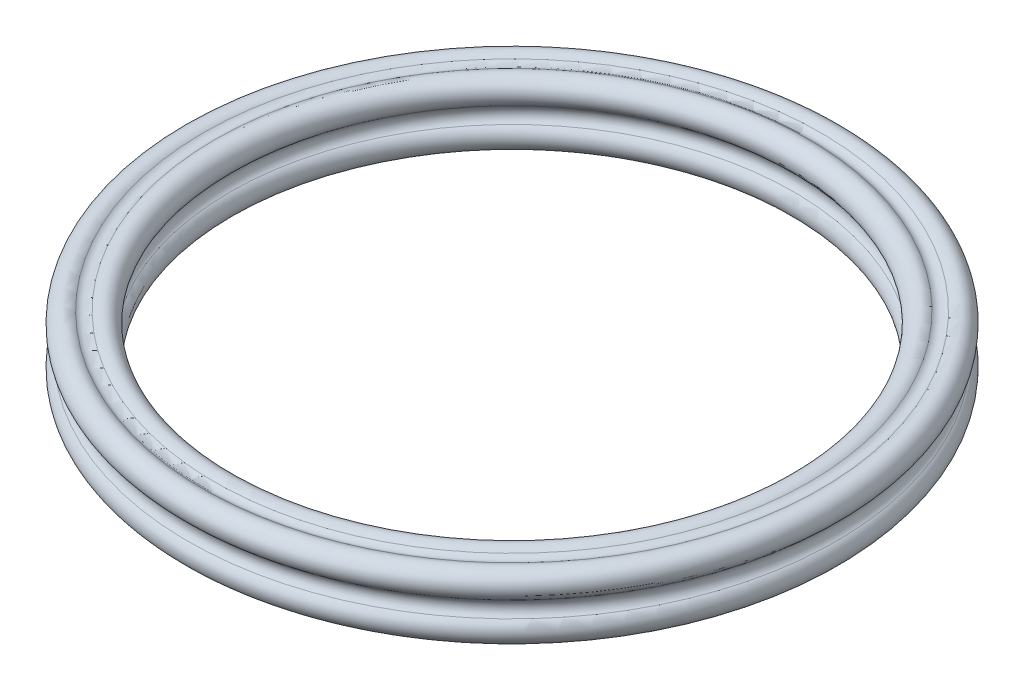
from build123d import *


with BuildPart() as part:
    # Esquisse1 → R_volution1 (revolve)
    with BuildSketch(Plane.XY):
        with BuildLine():
            ThreePointArc((-18.728871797, 3.74655875), (-18.375, 3.631306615), (-18.021128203, 3.74655875))
            ThreePointArc((-18.021128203, 3.74655875), (-16.898319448, 3.564017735), (-17.093148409, 2.443275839))
            ThreePointArc((-17.093148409, 2.443275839), (-17.350892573, 1.95), (-17.093148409, 1.456724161))
            ThreePointArc((-17.093148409, 1.456724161), (-16.898319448, 0.335982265), (-18.021128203, 0.15344125))
            ThreePointArc((-18.021128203, 0.15344125), (-18.375, 0.268693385), (-18.728871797, 0.15344125))
            ThreePointArc((-18.728871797, 0.15344125), (-19.851680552, 0.335982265), (-19.656851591, 1.456724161))
            ThreePointArc((-19.656851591, 1.456724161), (-19.399107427, 1.95), (-19.656851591, 2.443275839))
            ThreePointArc((-19.656851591, 2.443275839), (-19.851680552, 3.564017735), (-18.728871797, 3.74655875))
        make_face()
    revolve(axis=Axis((0, 7.710806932, 0), (0, -1, 0)))


solid = part.part
